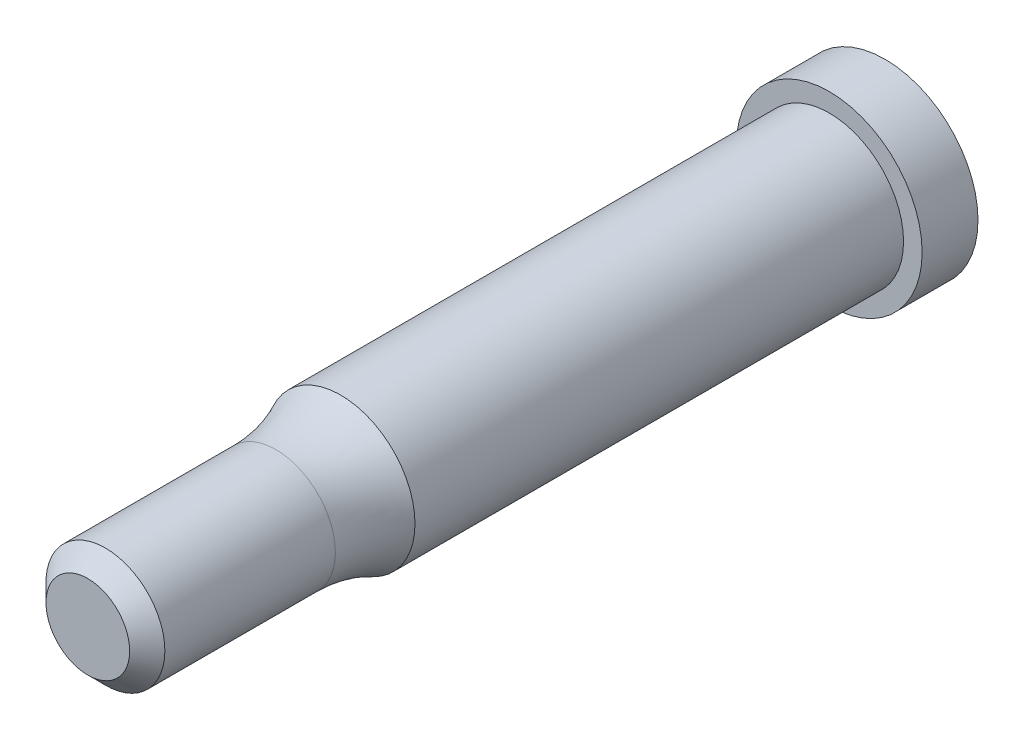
ISO-10303-21;
HEADER;
FILE_DESCRIPTION(('STEP AP214'),'2;1');
FILE_NAME('part.step','',(''),(''),'','','');
FILE_SCHEMA(('AUTOMOTIVE_DESIGN { 1 0 10303 214 1 1 1 1 }'));
ENDSEC;
DATA;
#1=APPLICATION_CONTEXT('core data for automotive mechanical design processes');
#2=APPLICATION_PROTOCOL_DEFINITION('international standard','automotive_design',2000,#1);
#3=PRODUCT_CONTEXT('',#1,'mechanical');
#4=PRODUCT('Part','Part','',(#3));
#5=PRODUCT_RELATED_PRODUCT_CATEGORY('part','',(#4));
#6=PRODUCT_DEFINITION_FORMATION('','',#4);
#7=PRODUCT_DEFINITION_CONTEXT('part definition',#1,'design');
#8=PRODUCT_DEFINITION('design','',#6,#7);
#9=PRODUCT_DEFINITION_SHAPE('','',#8);
#10=(LENGTH_UNIT() NAMED_UNIT(*) SI_UNIT(.MILLI.,.METRE.));
#11=(NAMED_UNIT(*) PLANE_ANGLE_UNIT() SI_UNIT($,.RADIAN.));
#12=(NAMED_UNIT(*) SI_UNIT($,.STERADIAN.) SOLID_ANGLE_UNIT());
#13=UNCERTAINTY_MEASURE_WITH_UNIT(LENGTH_MEASURE(1.E-05),#10,'distance_accuracy_value','');
#14=(GEOMETRIC_REPRESENTATION_CONTEXT(3) GLOBAL_UNCERTAINTY_ASSIGNED_CONTEXT((#13)) GLOBAL_UNIT_ASSIGNED_CONTEXT((#10,
#11,#12)) REPRESENTATION_CONTEXT('',''));
#15=CARTESIAN_POINT('',(0.,0.,0.));
#16=DIRECTION('',(0.,0.,1.));
#17=DIRECTION('',(1.,0.,0.));
#18=AXIS2_PLACEMENT_3D('',#15,#16,#17);
#19=CARTESIAN_POINT('',(0.,0.,43.5171681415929));
#20=DIRECTION('',(0.,0.,1.));
#21=DIRECTION('',(1.,0.,0.));
#22=AXIS2_PLACEMENT_3D('',#19,#20,#21);
#23=CYLINDRICAL_SURFACE('',#22,7.9375);
#24=CARTESIAN_POINT('',(0.,0.,0.));
#25=DIRECTION('',(0.,0.,1.));
#26=DIRECTION('',(1.,0.,0.));
#27=AXIS2_PLACEMENT_3D('',#24,#25,#26);
#28=CIRCLE('',#27,7.9375);
#29=CARTESIAN_POINT('',(7.9375,0.,0.));
#30=VERTEX_POINT('',#29);
#31=EDGE_CURVE('E10',#30,#30,#28,.T.);
#32=ORIENTED_EDGE('',*,*,#31,.F.);
#33=EDGE_LOOP('',(#32));
#34=FACE_BOUND('',#33,.T.);
#35=CARTESIAN_POINT('',(0.,0.,-4.7752));
#36=DIRECTION('',(0.,0.,1.));
#37=DIRECTION('',(1.,0.,0.));
#38=AXIS2_PLACEMENT_3D('',#35,#36,#37);
#39=CIRCLE('',#38,7.9375);
#40=CARTESIAN_POINT('',(7.9375,0.,-4.7752));
#41=VERTEX_POINT('',#40);
#42=EDGE_CURVE('E71',#41,#41,#39,.T.);
#43=ORIENTED_EDGE('',*,*,#42,.T.);
#44=EDGE_LOOP('',(#43));
#45=FACE_BOUND('',#44,.T.);
#46=ADVANCED_FACE('F47',(#34,#45),#23,.T.);
#47=CARTESIAN_POINT('',(-6.35,0.,0.));
#48=DIRECTION('',(0.,0.,-1.));
#49=DIRECTION('',(-1.,0.,0.));
#50=AXIS2_PLACEMENT_3D('',#47,#48,#49);
#51=PLANE('',#50);
#52=CARTESIAN_POINT('',(0.,0.,0.));
#53=DIRECTION('',(0.,0.,1.));
#54=DIRECTION('',(1.,0.,0.));
#55=AXIS2_PLACEMENT_3D('',#52,#53,#54);
#56=CIRCLE('',#55,6.35);
#57=CARTESIAN_POINT('',(6.35,0.,0.));
#58=VERTEX_POINT('',#57);
#59=EDGE_CURVE('E59',#58,#58,#56,.T.);
#60=ORIENTED_EDGE('',*,*,#59,.F.);
#61=EDGE_LOOP('',(#60));
#62=FACE_BOUND('',#61,.T.);
#63=ORIENTED_EDGE('',*,*,#31,.T.);
#64=EDGE_LOOP('',(#63));
#65=FACE_BOUND('',#64,.T.);
#66=ADVANCED_FACE('F106',(#62,#65),#51,.F.);
#67=CARTESIAN_POINT('',(0.,0.,43.5171681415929));
#68=DIRECTION('',(0.,0.,1.));
#69=DIRECTION('',(1.,0.,0.));
#70=AXIS2_PLACEMENT_3D('',#67,#68,#69);
#71=CYLINDRICAL_SURFACE('',#70,6.35);
#72=CARTESIAN_POINT('',(0.,0.,41.7576));
#73=DIRECTION('',(0.,0.,1.));
#74=DIRECTION('',(1.,0.,0.));
#75=AXIS2_PLACEMENT_3D('',#72,#73,#74);
#76=CIRCLE('',#75,6.34999999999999);
#77=CARTESIAN_POINT('',(6.34999999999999,0.,41.7576));
#78=VERTEX_POINT('',#77);
#79=EDGE_CURVE('E63',#78,#78,#76,.T.);
#80=ORIENTED_EDGE('',*,*,#79,.F.);
#81=EDGE_LOOP('',(#80));
#82=FACE_BOUND('',#81,.T.);
#83=ORIENTED_EDGE('',*,*,#59,.T.);
#84=EDGE_LOOP('',(#83));
#85=FACE_BOUND('',#84,.T.);
#86=ADVANCED_FACE('F103',(#82,#85),#71,.T.);
#87=CARTESIAN_POINT('',(0.,0.,47.2934016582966));
#88=DIRECTION('',(0.,0.,1.));
#89=DIRECTION('',(1.,0.,0.));
#90=AXIS2_PLACEMENT_3D('',#87,#88,#89);
#91=TOROIDAL_SURFACE('',#90,17.78,12.7);
#92=CARTESIAN_POINT('',(0.,0.,47.2934016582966));
#93=DIRECTION('',(0.,0.,1.));
#94=DIRECTION('',(1.,0.,0.));
#95=AXIS2_PLACEMENT_3D('',#92,#93,#94);
#96=CIRCLE('',#95,5.07999999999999);
#97=CARTESIAN_POINT('',(5.07999999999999,0.,47.2934016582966));
#98=VERTEX_POINT('',#97);
#99=EDGE_CURVE('E68',#98,#98,#96,.T.);
#100=ORIENTED_EDGE('',*,*,#99,.F.);
#101=EDGE_LOOP('',(#100));
#102=FACE_BOUND('',#101,.T.);
#103=ORIENTED_EDGE('',*,*,#79,.T.);
#104=EDGE_LOOP('',(#103));
#105=FACE_BOUND('',#104,.T.);
#106=ADVANCED_FACE('F99',(#102,#105),#91,.F.);
#107=CARTESIAN_POINT('',(0.,0.,43.5171681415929));
#108=DIRECTION('',(0.,0.,1.));
#109=DIRECTION('',(1.,0.,0.));
#110=AXIS2_PLACEMENT_3D('',#107,#108,#109);
#111=CYLINDRICAL_SURFACE('',#110,5.07999999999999);
#112=CARTESIAN_POINT('',(-3.59210244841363,-3.59210244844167,61.8650721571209));
#113=CARTESIAN_POINT('',(-3.76997061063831,-3.41422821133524,61.8650721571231));
#114=CARTESIAN_POINT('',(-3.93464407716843,-3.22307578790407,61.8650721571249));
#115=CARTESIAN_POINT('',(-4.23396538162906,-2.81839916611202,61.8650721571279));
#116=CARTESIAN_POINT('',(-4.36859071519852,-2.60485837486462,61.8650721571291));
#117=CARTESIAN_POINT('',(-4.6205931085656,-2.13025465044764,61.8650721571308));
#118=CARTESIAN_POINT('',(-4.73323566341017,-1.86665916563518,61.8650721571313));
#119=CARTESIAN_POINT('',(-4.91267294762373,-1.32427284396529,61.8650721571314));
#120=CARTESIAN_POINT('',(-4.97945738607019,-1.04547861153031,61.8650721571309));
#121=CARTESIAN_POINT('',(-5.06526914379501,-0.480650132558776,61.8650721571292));
#122=CARTESIAN_POINT('',(-5.08430059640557,-0.194616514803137,61.8650721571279));
#123=CARTESIAN_POINT('',(-5.07407000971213,0.376568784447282,61.8650721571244));
#124=CARTESIAN_POINT('',(-5.04481044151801,0.661720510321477,61.8650721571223));
#125=CARTESIAN_POINT('',(-4.9388341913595,1.22307121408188,61.8650721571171));
#126=CARTESIAN_POINT('',(-4.86211652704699,1.49927000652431,61.8650721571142));
#127=CARTESIAN_POINT('',(-4.66339940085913,2.03487010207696,61.8650721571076));
#128=CARTESIAN_POINT('',(-4.5413994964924,2.29427124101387,61.8650721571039));
#129=CARTESIAN_POINT('',(-4.25558200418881,2.78890851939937,61.865072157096));
#130=CARTESIAN_POINT('',(-4.0917645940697,3.02414476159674,61.8650721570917));
#131=CARTESIAN_POINT('',(-3.72696232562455,3.4637755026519,61.8650721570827));
#132=CARTESIAN_POINT('',(-3.52597751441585,3.66817004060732,61.8650721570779));
#133=CARTESIAN_POINT('',(-3.09254553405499,4.04031571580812,61.8650721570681));
#134=CARTESIAN_POINT('',(-2.86009834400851,4.20806682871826,61.865072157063));
#135=CARTESIAN_POINT('',(-2.37034021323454,4.50216350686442,61.8650721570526));
#136=CARTESIAN_POINT('',(-2.11302927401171,4.62850907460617,61.8650721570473));
#137=CARTESIAN_POINT('',(-1.58084794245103,4.83620809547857,61.8650721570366));
#138=CARTESIAN_POINT('',(-1.30597755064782,4.91756154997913,61.8650721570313));
#139=CARTESIAN_POINT('',(-0.746480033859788,5.0329669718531,61.8650721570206));
#140=CARTESIAN_POINT('',(-0.461852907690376,5.06701893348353,61.8650721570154));
#141=CARTESIAN_POINT('',(0.109078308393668,5.08685471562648,61.8650721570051));
#142=CARTESIAN_POINT('',(0.39538239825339,5.07263853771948,61.8650721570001));
#143=CARTESIAN_POINT('',(0.961540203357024,4.99634160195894,61.8650721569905));
#144=CARTESIAN_POINT('',(1.24139391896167,4.9342608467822,61.8650721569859));
#145=CARTESIAN_POINT('',(1.78670677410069,4.76399704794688,61.8650721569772));
#146=CARTESIAN_POINT('',(2.05216591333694,4.65581400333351,61.8650721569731));
#147=CARTESIAN_POINT('',(2.56115400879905,4.39641662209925,61.8650721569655));
#148=CARTESIAN_POINT('',(2.80468296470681,4.24520228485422,61.8650721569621));
#149=CARTESIAN_POINT('',(3.26289761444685,3.90403485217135,61.8650721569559));
#150=CARTESIAN_POINT('',(3.47758330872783,3.71408175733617,61.8650721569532));
#151=CARTESIAN_POINT('',(3.87201714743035,3.30082901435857,61.8650721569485));
#152=CARTESIAN_POINT('',(4.05176529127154,3.07752936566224,61.8650721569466));
#153=CARTESIAN_POINT('',(4.37122150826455,2.60392233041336,61.8650721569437));
#154=CARTESIAN_POINT('',(4.51092958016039,2.35361494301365,61.8650721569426));
#155=CARTESIAN_POINT('',(4.74633973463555,1.83309794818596,61.8650721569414));
#156=CARTESIAN_POINT('',(4.84204182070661,1.56288834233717,61.8650721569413));
#157=CARTESIAN_POINT('',(4.98672331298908,1.01023737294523,61.8650721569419));
#158=CARTESIAN_POINT('',(5.03570272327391,0.727796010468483,61.8650721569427));
#159=CARTESIAN_POINT('',(5.08554850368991,0.158699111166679,61.8650721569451));
#160=CARTESIAN_POINT('',(5.0864148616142,-0.127956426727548,61.8650721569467));
#161=CARTESIAN_POINT('',(5.04000990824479,-0.697344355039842,61.8650721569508));
#162=CARTESIAN_POINT('',(4.99273858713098,-0.980076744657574,61.8650721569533));
#163=CARTESIAN_POINT('',(4.85140020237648,-1.53359218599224,61.865072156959));
#164=CARTESIAN_POINT('',(4.75733316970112,-1.80437524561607,61.8650721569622));
#165=CARTESIAN_POINT('',(4.52507368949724,-2.3263054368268,61.8650721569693));
#166=CARTESIAN_POINT('',(4.38688125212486,-2.5774525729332,61.8650721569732));
#167=CARTESIAN_POINT('',(4.07029364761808,-3.0529819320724,61.8650721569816));
#168=CARTESIAN_POINT('',(3.89189843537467,-3.27736412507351,61.8650721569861));
#169=CARTESIAN_POINT('',(3.49996973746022,-3.69299346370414,61.8650721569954));
#170=CARTESIAN_POINT('',(3.28643629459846,-3.88424064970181,61.8650721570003));
#171=CARTESIAN_POINT('',(2.83029223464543,-4.22817157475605,61.8650721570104));
#172=CARTESIAN_POINT('',(2.58768157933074,-4.38085526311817,61.8650721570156));
#173=CARTESIAN_POINT('',(2.08026742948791,-4.64332625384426,61.8650721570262));
#174=CARTESIAN_POINT('',(1.81546367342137,-4.7531130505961,61.8650721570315));
#175=CARTESIAN_POINT('',(1.27118937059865,-4.92666860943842,61.8650721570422));
#176=CARTESIAN_POINT('',(0.991719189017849,-4.99043851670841,61.8650721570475));
#177=CARTESIAN_POINT('',(0.426059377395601,-5.07015311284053,61.865072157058));
#178=CARTESIAN_POINT('',(0.139870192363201,-5.08610096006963,61.8650721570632));
#179=CARTESIAN_POINT('',(-0.431173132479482,-5.06972212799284,61.8650721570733));
#180=CARTESIAN_POINT('',(-0.716027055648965,-5.03738786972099,61.8650721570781));
#181=CARTESIAN_POINT('',(-1.27633115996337,-4.92534813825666,61.8650721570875));
#182=CARTESIAN_POINT('',(-1.55177848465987,-4.84562840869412,61.8650721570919));
#183=CARTESIAN_POINT('',(-2.08522794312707,-4.6410877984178,61.8650721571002));
#184=CARTESIAN_POINT('',(-2.34324315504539,-4.5163011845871,61.8650721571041));
#185=CARTESIAN_POINT('',(-2.77152105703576,-4.26265533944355,61.8650721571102));
#186=CARTESIAN_POINT('',(-2.94732913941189,-4.14303197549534,61.8650721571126));
#187=CARTESIAN_POINT('',(-3.28258623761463,-3.88278601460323,61.8650721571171));
#188=CARTESIAN_POINT('',(-3.44204021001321,-3.74216981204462,61.8650721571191));
#189=CARTESIAN_POINT('',(-3.59210244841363,-3.59210244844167,61.8650721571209));
#190=B_SPLINE_CURVE_WITH_KNOTS('',3,(#112,#113,#114,#115,#116,#117,#118,#119,#120,#121,#122,
#123,#124,#125,#126,#127,#128,#129,#130,#131,#132,#133,#134,#135,#136,#137,#138,#139,#140,#141,
#142,#143,#144,#145,#146,#147,#148,#149,#150,#151,#152,#153,#154,#155,#156,#157,#158,#159,#160,
#161,#162,#163,#164,#165,#166,#167,#168,#169,#170,#171,#172,#173,#174,#175,#176,#177,#178,#179,
#180,#181,#182,#183,#184,#185,#186,#187,#188,#189),.UNSPECIFIED.,.T.,.F.,(4,2,2,2,2,2,2,2,2,2,2,
2,2,2,2,2,2,2,2,2,2,2,2,2,2,2,2,2,2,2,2,2,2,2,2,2,2,2,4),(0.,0.754042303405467,1.50864746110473,
2.36445322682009,3.22045097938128,4.07637463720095,4.93225449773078,5.7881520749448,
6.64405801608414,7.49996031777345,8.35586153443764,9.2117633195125,10.0676650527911,
10.9235667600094,11.7794685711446,12.6353703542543,13.4912720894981,14.3471738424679,
15.2030756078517,16.0589773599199,16.9148791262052,17.7707809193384,18.6266826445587,
19.4825842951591,20.3384861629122,21.1943882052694,22.0502896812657,22.9061909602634,
23.7620931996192,24.6179943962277,25.4738967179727,26.3298091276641,27.1857002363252,
28.0415348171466,28.897503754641,29.753730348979,30.6093072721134,31.2456644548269,
31.8818281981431),.UNSPECIFIED.);
#191=CARTESIAN_POINT('',(-3.59210244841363,-3.59210244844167,61.8650721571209));
#192=VERTEX_POINT('',#191);
#193=EDGE_CURVE('E50',#192,#192,#190,.T.);
#194=ORIENTED_EDGE('',*,*,#193,.T.);
#195=EDGE_LOOP('',(#194));
#196=FACE_BOUND('',#195,.T.);
#197=ORIENTED_EDGE('',*,*,#99,.T.);
#198=EDGE_LOOP('',(#197));
#199=FACE_BOUND('',#198,.T.);
#200=ADVANCED_FACE('F94',(#196,#199),#111,.T.);
#201=CARTESIAN_POINT('',(-7.9375,0.,-4.7752));
#202=DIRECTION('',(0.,0.,1.));
#203=DIRECTION('',(1.,0.,0.));
#204=AXIS2_PLACEMENT_3D('',#201,#202,#203);
#205=PLANE('',#204);
#206=ORIENTED_EDGE('',*,*,#42,.F.);
#207=EDGE_LOOP('',(#206));
#208=FACE_BOUND('',#207,.T.);
#209=ADVANCED_FACE('F92',(#208),#205,.F.);
#210=CARTESIAN_POINT('',(5.59878568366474E-12,1.83045436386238E-12,62.8391051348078));
#211=DIRECTION('',(-1.58417609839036E-11,-5.1379867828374E-12,-1.));
#212=DIRECTION('',(0.655690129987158,-0.755030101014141,-6.50795163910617E-12));
#213=AXIS2_PLACEMENT_3D('',#210,#211,#212);
#214=CONICAL_SURFACE('',#213,4.10596702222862,0.785398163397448);
#215=CARTESIAN_POINT('',(-3.57384719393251,4.56606611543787E-12,63.3712249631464));
#216=CARTESIAN_POINT('',(-3.57385172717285,-0.0589994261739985,63.3712249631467));
#217=CARTESIAN_POINT('',(-3.57244306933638,-0.118001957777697,63.371224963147));
#218=CARTESIAN_POINT('',(-3.56677081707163,-0.235436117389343,63.3712249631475));
#219=CARTESIAN_POINT('',(-3.56252819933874,-0.29386876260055,63.3712249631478));
#220=CARTESIAN_POINT('',(-3.5511891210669,-0.410163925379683,63.3712249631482));
#221=CARTESIAN_POINT('',(-3.54410697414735,-0.468027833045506,63.3712249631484));
#222=CARTESIAN_POINT('',(-3.52709713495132,-0.583184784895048,63.3712249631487));
#223=CARTESIAN_POINT('',(-3.51717677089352,-0.640478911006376,63.3712249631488));
#224=CARTESIAN_POINT('',(-3.49449724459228,-0.754496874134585,63.3712249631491));
#225=CARTESIAN_POINT('',(-3.48173835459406,-0.811220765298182,63.3712249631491));
#226=CARTESIAN_POINT('',(-3.45338888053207,-0.924099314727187,63.3712249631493));
#227=CARTESIAN_POINT('',(-3.4377916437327,-0.980252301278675,63.3712249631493));
#228=CARTESIAN_POINT('',(-3.40377272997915,-1.09199117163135,63.3712249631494));
#229=CARTESIAN_POINT('',(-3.38533781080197,-1.14757302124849,63.3712249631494));
#230=CARTESIAN_POINT('',(-3.34564859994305,-1.25817108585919,63.3712249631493));
#231=CARTESIAN_POINT('',(-3.32437497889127,-1.31318035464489,63.3712249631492));
#232=CARTESIAN_POINT('',(-3.27921174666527,-1.42217653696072,63.3712249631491));
#233=CARTESIAN_POINT('',(-3.25531962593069,-1.47616241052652,63.371224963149));
#234=CARTESIAN_POINT('',(-3.20511679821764,-1.58251053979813,63.3712249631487));
#235=CARTESIAN_POINT('',(-3.17882531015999,-1.63488185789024,63.3712249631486));
#236=CARTESIAN_POINT('',(-3.12382857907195,-1.73800139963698,63.3712249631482));
#237=CARTESIAN_POINT('',(-3.09513624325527,-1.7887565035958,63.3712249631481));
#238=CARTESIAN_POINT('',(-3.03534465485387,-1.88864624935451,63.3712249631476));
#239=CARTESIAN_POINT('',(-3.00425198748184,-1.93778483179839,63.3712249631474));
#240=CARTESIAN_POINT('',(-2.93966603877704,-2.03444459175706,63.3712249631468));
#241=CARTESIAN_POINT('',(-2.90617321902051,-2.08196607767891,63.3712249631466));
#242=CARTESIAN_POINT('',(-2.83679302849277,-2.17539531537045,63.371224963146));
#243=CARTESIAN_POINT('',(-2.80090037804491,-2.22129914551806,63.3712249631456));
#244=CARTESIAN_POINT('',(-2.72672650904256,-2.31149786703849,63.3712249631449));
#245=CARTESIAN_POINT('',(-2.68843481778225,-2.35578414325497,63.3712249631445));
#246=CARTESIAN_POINT('',(-2.60946673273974,-2.44275078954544,63.3712249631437));
#247=CARTESIAN_POINT('',(-2.56877534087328,-2.48541752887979,63.3712249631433));
#248=CARTESIAN_POINT('',(-2.48535343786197,-2.56882002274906,63.3712249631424));
#249=CARTESIAN_POINT('',(-2.44262033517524,-2.60955318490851,63.3712249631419));
#250=CARTESIAN_POINT('',(-2.35554118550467,-2.68859413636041,63.371224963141));
#251=CARTESIAN_POINT('',(-2.31120942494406,-2.72691765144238,63.3712249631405));
#252=CARTESIAN_POINT('',(-2.22093696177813,-2.80114137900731,63.3712249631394));
#253=CARTESIAN_POINT('',(-2.17500555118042,-2.83705288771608,63.3712249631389));
#254=CARTESIAN_POINT('',(-2.08153916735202,-2.90645772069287,63.3712249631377));
#255=CARTESIAN_POINT('',(-2.03400877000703,-2.93995720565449,63.3712249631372));
#256=CARTESIAN_POINT('',(-1.93734904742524,-3.0045432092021,63.371224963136));
#257=CARTESIAN_POINT('',(-1.88822003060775,-3.03563018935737,63.3712249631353));
#258=CARTESIAN_POINT('',(-1.78836727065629,-3.09539689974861,63.3712249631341));
#259=CARTESIAN_POINT('',(-1.73764015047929,-3.1240709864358,63.3712249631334));
#260=CARTESIAN_POINT('',(-1.63459487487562,-3.17901862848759,63.3712249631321));
#261=CARTESIAN_POINT('',(-1.5822703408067,-3.20528021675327,63.3712249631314));
#262=CARTESIAN_POINT('',(-1.47603264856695,-3.25540714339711,63.3712249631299));
#263=CARTESIAN_POINT('',(-1.42211085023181,-3.27925414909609,63.3712249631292));
#264=CARTESIAN_POINT('',(-1.31312230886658,-3.32438382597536,63.3712249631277));
#265=CARTESIAN_POINT('',(-1.25805416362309,-3.34566311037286,63.3712249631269));
#266=CARTESIAN_POINT('',(-1.14735585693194,-3.38536367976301,63.3712249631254));
#267=CARTESIAN_POINT('',(-1.09173287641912,-3.40380496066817,63.3712249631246));
#268=CARTESIAN_POINT('',(-0.979927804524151,-3.43783296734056,63.371224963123));
#269=CARTESIAN_POINT('',(-0.9237499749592,-3.45343368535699,63.3712249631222));
#270=CARTESIAN_POINT('',(-0.810838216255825,-3.48178735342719,63.3712249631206));
#271=CARTESIAN_POINT('',(-0.754106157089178,-3.49454774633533,63.3712249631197));
#272=CARTESIAN_POINT('',(-0.640088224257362,-3.51722735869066,63.371224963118));
#273=CARTESIAN_POINT('',(-0.582802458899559,-3.52714712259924,63.3712249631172));
#274=CARTESIAN_POINT('',(-0.467678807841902,-3.54415236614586,63.3712249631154));
#275=CARTESIAN_POINT('',(-0.409839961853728,-3.55123133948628,63.3712249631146));
#276=CARTESIAN_POINT('',(-0.2936109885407,-3.56256262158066,63.3712249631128));
#277=CARTESIAN_POINT('',(-0.235219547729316,-3.56680143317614,63.3712249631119));
#278=CARTESIAN_POINT('',(-0.117885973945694,-3.57245727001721,63.3712249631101));
#279=CARTESIAN_POINT('',(-0.0589428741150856,-3.57385405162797,63.3712249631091));
#280=CARTESIAN_POINT('',(0.0590197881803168,-3.57384032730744,63.3712249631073));
#281=CARTESIAN_POINT('',(0.118039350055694,-3.57242615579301,63.3712249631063));
#282=CARTESIAN_POINT('',(0.235504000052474,-3.56674229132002,63.3712249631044));
#283=CARTESIAN_POINT('',(0.29395010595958,-3.56249382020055,63.3712249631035));
#284=CARTESIAN_POINT('',(0.410266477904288,-3.55114565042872,63.3712249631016));
#285=CARTESIAN_POINT('',(0.468138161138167,-3.54406050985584,63.3712249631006));
#286=CARTESIAN_POINT('',(0.583305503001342,-3.52704642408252,63.3712249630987));
#287=CARTESIAN_POINT('',(0.64060228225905,-3.51712507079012,63.3712249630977));
#288=CARTESIAN_POINT('',(0.754620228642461,-3.49444552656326,63.3712249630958));
#289=CARTESIAN_POINT('',(0.811341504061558,-3.48168788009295,63.3712249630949));
#290=CARTESIAN_POINT('',(0.924209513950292,-3.45334276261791,63.3712249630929));
#291=CARTESIAN_POINT('',(0.980354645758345,-3.43774891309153,63.371224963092));
#292=CARTESIAN_POINT('',(1.09207250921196,-3.40373875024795,63.37122496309));
#293=CARTESIAN_POINT('',(1.14764128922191,-3.38530946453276,63.371224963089));
#294=CARTESIAN_POINT('',(1.25820777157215,-3.34563316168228,63.3712249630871));
#295=CARTESIAN_POINT('',(1.31319862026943,-3.32436707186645,63.3712249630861));
#296=CARTESIAN_POINT('',(1.4221766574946,-3.27921203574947,63.3712249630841));
#297=CARTESIAN_POINT('',(1.47616244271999,-3.25531970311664,63.3712249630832));
#298=CARTESIAN_POINT('',(1.58251050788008,-3.20511672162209,63.3712249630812));
#299=CARTESIAN_POINT('',(1.63488184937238,-3.17882528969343,63.3712249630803));
#300=CARTESIAN_POINT('',(1.73800140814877,-3.12382859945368,63.3712249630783));
#301=CARTESIAN_POINT('',(1.78875650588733,-3.09513624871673,63.3712249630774));
#302=CARTESIAN_POINT('',(1.88864624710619,-3.03534464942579,63.3712249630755));
#303=CARTESIAN_POINT('',(1.93778483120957,-3.00425198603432,63.3712249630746));
#304=CARTESIAN_POINT('',(2.03444459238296,-2.93966604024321,63.3712249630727));
#305=CARTESIAN_POINT('',(2.08196607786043,-2.90617321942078,63.3712249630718));
#306=CARTESIAN_POINT('',(2.17539531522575,-2.83679302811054,63.3712249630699));
#307=CARTESIAN_POINT('',(2.22129914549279,-2.80090037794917,63.371224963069));
#308=CARTESIAN_POINT('',(2.31149786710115,-2.72672650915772,63.3712249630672));
#309=CARTESIAN_POINT('',(2.35578414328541,-2.68843481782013,63.3712249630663));
#310=CARTESIAN_POINT('',(2.4427507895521,-2.60946673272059,63.3712249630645));
#311=CARTESIAN_POINT('',(2.48541752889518,-2.56877534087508,63.3712249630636));
#312=CARTESIAN_POINT('',(2.56882002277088,-2.48535343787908,63.3712249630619));
#313=CARTESIAN_POINT('',(2.60955318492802,-2.44262033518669,63.371224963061));
#314=CARTESIAN_POINT('',(2.68859413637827,-2.35554118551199,63.3712249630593));
#315=CARTESIAN_POINT('',(2.72691765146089,-2.31120942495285,63.3712249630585));
#316=CARTESIAN_POINT('',(2.8011413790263,-2.22093696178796,63.3712249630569));
#317=CARTESIAN_POINT('',(2.83705288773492,-2.17500555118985,63.3712249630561));
#318=CARTESIAN_POINT('',(2.9064577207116,-2.08153916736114,63.3712249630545));
#319=CARTESIAN_POINT('',(2.93995720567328,-2.03400877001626,63.3712249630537));
#320=CARTESIAN_POINT('',(3.00454320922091,-1.93734904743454,63.3712249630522));
#321=CARTESIAN_POINT('',(3.03563018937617,-1.88822003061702,63.3712249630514));
#322=CARTESIAN_POINT('',(3.09539689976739,-1.78836727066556,63.37122496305));
#323=CARTESIAN_POINT('',(3.12407098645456,-1.73764015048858,63.3712249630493));
#324=CARTESIAN_POINT('',(3.17901862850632,-1.63459487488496,63.3712249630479));
#325=CARTESIAN_POINT('',(3.20528021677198,-1.58227034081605,63.3712249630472));
#326=CARTESIAN_POINT('',(3.25540714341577,-1.47603264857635,63.3712249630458));
#327=CARTESIAN_POINT('',(3.27925414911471,-1.42211085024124,63.3712249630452));
#328=CARTESIAN_POINT('',(3.32438382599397,-1.31312230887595,63.3712249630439));
#329=CARTESIAN_POINT('',(3.3456631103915,-1.25805416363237,63.3712249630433));
#330=CARTESIAN_POINT('',(3.38536367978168,-1.14735585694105,63.3712249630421));
#331=CARTESIAN_POINT('',(3.40380496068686,-1.09173287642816,63.3712249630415));
#332=CARTESIAN_POINT('',(3.43783296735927,-0.97992780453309,63.3712249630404));
#333=CARTESIAN_POINT('',(3.45343368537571,-0.923749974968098,63.3712249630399));
#334=CARTESIAN_POINT('',(3.48178735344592,-0.81083821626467,63.3712249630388));
#335=CARTESIAN_POINT('',(3.49454774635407,-0.754106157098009,63.3712249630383));
#336=CARTESIAN_POINT('',(3.5172273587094,-0.640088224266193,63.3712249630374));
#337=CARTESIAN_POINT('',(3.52714712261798,-0.582802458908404,63.3712249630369));
#338=CARTESIAN_POINT('',(3.54415236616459,-0.4676788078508,63.3712249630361));
#339=CARTESIAN_POINT('',(3.55123133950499,-0.409839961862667,63.3712249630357));
#340=CARTESIAN_POINT('',(3.56256262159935,-0.293610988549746,63.3712249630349));
#341=CARTESIAN_POINT('',(3.56680143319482,-0.23521954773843,63.3712249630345));
#342=CARTESIAN_POINT('',(3.57245727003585,-0.11788597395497,63.3712249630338));
#343=CARTESIAN_POINT('',(3.57385405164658,-0.0589428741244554,63.3712249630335));
#344=CARTESIAN_POINT('',(3.57384032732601,0.0590197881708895,63.3712249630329));
#345=CARTESIAN_POINT('',(3.57242615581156,0.118039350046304,63.3712249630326));
#346=CARTESIAN_POINT('',(3.56674229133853,0.235504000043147,63.3712249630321));
#347=CARTESIAN_POINT('',(3.56249382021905,0.293950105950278,63.3712249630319));
#348=CARTESIAN_POINT('',(3.55114565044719,0.410266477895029,63.3712249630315));
#349=CARTESIAN_POINT('',(3.54406050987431,0.468138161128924,63.3712249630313));
#350=CARTESIAN_POINT('',(3.52704642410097,0.583305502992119,63.3712249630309));
#351=CARTESIAN_POINT('',(3.51712507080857,0.640602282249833,63.3712249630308));
#352=CARTESIAN_POINT('',(3.4944455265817,0.754620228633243,63.3712249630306));
#353=CARTESIAN_POINT('',(3.48168788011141,0.811341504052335,63.3712249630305));
#354=CARTESIAN_POINT('',(3.45334276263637,0.924209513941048,63.3712249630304));
#355=CARTESIAN_POINT('',(3.43774891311,0.980354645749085,63.3712249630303));
#356=CARTESIAN_POINT('',(3.40373875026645,1.09207250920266,63.3712249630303));
#357=CARTESIAN_POINT('',(3.38530946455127,1.14764128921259,63.3712249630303));
#358=CARTESIAN_POINT('',(3.34563316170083,1.25820777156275,63.3712249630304));
#359=CARTESIAN_POINT('',(3.32436707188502,1.31319862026,63.3712249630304));
#360=CARTESIAN_POINT('',(3.2792120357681,1.42217665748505,63.3712249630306));
#361=CARTESIAN_POINT('',(3.25531970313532,1.47616244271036,63.3712249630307));
#362=CARTESIAN_POINT('',(3.20511672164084,1.58251050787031,63.3712249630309));
#363=CARTESIAN_POINT('',(3.1788252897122,1.63488184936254,63.3712249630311));
#364=CARTESIAN_POINT('',(3.1238285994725,1.73800140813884,63.3712249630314));
#365=CARTESIAN_POINT('',(3.09513624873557,1.78875650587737,63.3712249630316));
#366=CARTESIAN_POINT('',(3.03534464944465,1.88864624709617,63.371224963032));
#367=CARTESIAN_POINT('',(3.00425198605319,1.93778483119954,63.3712249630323));
#368=CARTESIAN_POINT('',(2.93966604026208,2.03444459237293,63.3712249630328));
#369=CARTESIAN_POINT('',(2.90617321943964,2.08196607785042,63.3712249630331));
#370=CARTESIAN_POINT('',(2.83679302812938,2.17539531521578,63.3712249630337));
#371=CARTESIAN_POINT('',(2.80090037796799,2.22129914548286,63.3712249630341));
#372=CARTESIAN_POINT('',(2.7267265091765,2.31149786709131,63.3712249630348));
#373=CARTESIAN_POINT('',(2.68843481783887,2.35578414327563,63.3712249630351));
#374=CARTESIAN_POINT('',(2.60946673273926,2.44275078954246,63.3712249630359));
#375=CARTESIAN_POINT('',(2.56877534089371,2.48541752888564,63.3712249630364));
#376=CARTESIAN_POINT('',(2.48535343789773,2.5688200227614,63.3712249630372));
#377=CARTESIAN_POINT('',(2.4426203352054,2.60955318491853,63.3712249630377));
#378=CARTESIAN_POINT('',(2.3555411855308,2.68859413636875,63.3712249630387));
#379=CARTESIAN_POINT('',(2.3112094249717,2.72691765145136,63.3712249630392));
#380=CARTESIAN_POINT('',(2.22093696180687,2.80114137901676,63.3712249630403));
#381=CARTESIAN_POINT('',(2.17500555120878,2.83705288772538,63.3712249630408));
#382=CARTESIAN_POINT('',(2.08153916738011,2.90645772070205,63.3712249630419));
#383=CARTESIAN_POINT('',(2.03400877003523,2.93995720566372,63.3712249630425));
#384=CARTESIAN_POINT('',(1.93734904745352,3.00454320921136,63.3712249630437));
#385=CARTESIAN_POINT('',(1.88822003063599,3.03563018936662,63.3712249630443));
#386=CARTESIAN_POINT('',(1.7883672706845,3.09539689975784,63.3712249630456));
#387=CARTESIAN_POINT('',(1.73764015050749,3.12407098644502,63.3712249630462));
#388=CARTESIAN_POINT('',(1.6345948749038,3.1790186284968,63.3712249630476));
#389=CARTESIAN_POINT('',(1.58227034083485,3.20528021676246,63.3712249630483));
#390=CARTESIAN_POINT('',(1.47603264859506,3.25540714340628,63.3712249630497));
#391=CARTESIAN_POINT('',(1.42211085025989,3.27925414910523,63.3712249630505));
#392=CARTESIAN_POINT('',(1.31312230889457,3.32438382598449,63.371224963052));
#393=CARTESIAN_POINT('',(1.25805416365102,3.34566311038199,63.3712249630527));
#394=CARTESIAN_POINT('',(1.14735585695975,3.38536367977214,63.3712249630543));
#395=CARTESIAN_POINT('',(1.09173287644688,3.4038049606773,63.371224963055));
#396=CARTESIAN_POINT('',(0.97992780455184,3.43783296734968,63.3712249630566));
#397=CARTESIAN_POINT('',(0.923749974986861,3.45343368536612,63.3712249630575));
#398=CARTESIAN_POINT('',(0.81083821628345,3.48178735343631,63.3712249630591));
#399=CARTESIAN_POINT('',(0.754106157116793,3.49454774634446,63.3712249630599));
#400=CARTESIAN_POINT('',(0.640088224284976,3.51722735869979,63.3712249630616));
#401=CARTESIAN_POINT('',(0.582802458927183,3.52714712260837,63.3712249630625));
#402=CARTESIAN_POINT('',(0.467678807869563,3.54415236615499,63.3712249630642));
#403=CARTESIAN_POINT('',(0.409839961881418,3.55123133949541,63.3712249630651));
#404=CARTESIAN_POINT('',(0.293610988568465,3.56256262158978,63.3712249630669));
#405=CARTESIAN_POINT('',(0.235219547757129,3.56680143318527,63.3712249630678));
#406=CARTESIAN_POINT('',(0.11788597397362,3.57245727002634,63.3712249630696));
#407=CARTESIAN_POINT('',(0.0589428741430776,3.5738540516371,63.3712249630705));
#408=CARTESIAN_POINT('',(-0.059019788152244,3.57384032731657,63.3712249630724));
#409=CARTESIAN_POINT('',(-0.118039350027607,3.57242615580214,63.3712249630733));
#410=CARTESIAN_POINT('',(-0.235504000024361,3.56674229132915,63.3712249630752));
#411=CARTESIAN_POINT('',(-0.293950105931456,3.56249382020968,63.3712249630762));
#412=CARTESIAN_POINT('',(-0.410266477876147,3.55114565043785,63.3712249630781));
#413=CARTESIAN_POINT('',(-0.46813816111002,3.54406050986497,63.371224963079));
#414=CARTESIAN_POINT('',(-0.583305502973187,3.52704642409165,63.371224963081));
#415=CARTESIAN_POINT('',(-0.640602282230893,3.51712507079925,63.3712249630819));
#416=CARTESIAN_POINT('',(-0.754620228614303,3.49444552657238,63.3712249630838));
#417=CARTESIAN_POINT('',(-0.811341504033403,3.48168788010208,63.3712249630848));
#418=CARTESIAN_POINT('',(-0.924209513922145,3.45334276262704,63.3712249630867));
#419=CARTESIAN_POINT('',(-0.980354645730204,3.43774891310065,63.3712249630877));
#420=CARTESIAN_POINT('',(-1.09207250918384,3.40373875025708,63.3712249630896));
#421=CARTESIAN_POINT('',(-1.1476412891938,3.38530946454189,63.3712249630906));
#422=CARTESIAN_POINT('',(-1.25820777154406,3.34563316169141,63.3712249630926));
#423=CARTESIAN_POINT('',(-1.31319862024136,3.32436707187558,63.3712249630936));
#424=CARTESIAN_POINT('',(-1.42217665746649,3.27921203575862,63.3712249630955));
#425=CARTESIAN_POINT('',(-1.47616244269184,3.25531970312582,63.3712249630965));
#426=CARTESIAN_POINT('',(-1.58251050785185,3.20511672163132,63.3712249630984));
#427=CARTESIAN_POINT('',(-1.63488184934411,3.17882528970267,63.3712249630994));
#428=CARTESIAN_POINT('',(-1.73800140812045,3.12382859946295,63.3712249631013));
#429=CARTESIAN_POINT('',(-1.78875650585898,3.09513624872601,63.3712249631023));
#430=CARTESIAN_POINT('',(-1.88864624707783,3.03534464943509,63.3712249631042));
#431=CARTESIAN_POINT('',(-1.93778483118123,3.00425198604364,63.3712249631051));
#432=CARTESIAN_POINT('',(-2.03444459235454,2.93966604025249,63.3712249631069));
#433=CARTESIAN_POINT('',(-2.08196607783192,2.90617321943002,63.3712249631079));
#434=CARTESIAN_POINT('',(-2.17539531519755,2.83679302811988,63.3712249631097));
#435=CARTESIAN_POINT('',(-2.22129914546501,2.80090037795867,63.3712249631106));
#436=CARTESIAN_POINT('',(-2.31149786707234,2.72672650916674,63.3712249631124));
#437=CARTESIAN_POINT('',(-2.35578414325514,2.68843481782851,63.3712249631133));
#438=CARTESIAN_POINT('',(-2.44275078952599,2.60946673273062,63.3712249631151));
#439=CARTESIAN_POINT('',(-2.48541752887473,2.56877534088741,63.371224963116));
#440=CARTESIAN_POINT('',(-2.56882002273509,2.48535343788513,63.3712249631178));
#441=CARTESIAN_POINT('',(-2.6095531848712,2.44262033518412,63.3712249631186));
#442=CARTESIAN_POINT('',(-2.68859413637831,2.3555411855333,63.3712249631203));
#443=CARTESIAN_POINT('',(-2.72691765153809,2.31120942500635,63.3712249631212));
#444=CARTESIAN_POINT('',(-2.80114137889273,2.22093696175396,63.3712249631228));
#445=CARTESIAN_POINT('',(-2.83705288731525,2.17500555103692,63.3712249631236));
#446=CARTESIAN_POINT('',(-2.90645772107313,2.08153916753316,63.3712249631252));
#447=CARTESIAN_POINT('',(-2.9399572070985,2.03400877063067,63.3712249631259));
#448=CARTESIAN_POINT('',(-3.00454320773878,1.93734904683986,63.3712249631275));
#449=CARTESIAN_POINT('',(-3.03563018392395,1.88822002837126,63.3712249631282));
#450=CARTESIAN_POINT('',(-3.09539690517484,1.78836727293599,63.3712249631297));
#451=CARTESIAN_POINT('',(-3.1240710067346,1.73764015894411,63.3712249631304));
#452=CARTESIAN_POINT('',(-3.17901860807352,1.63459486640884,63.3712249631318));
#453=CARTESIAN_POINT('',(-3.20528014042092,1.58227030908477,63.3712249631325));
#454=CARTESIAN_POINT('',(-3.25540722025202,1.47603268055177,63.3712249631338));
#455=CARTESIAN_POINT('',(-3.27925443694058,1.42211096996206,63.3712249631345));
#456=CARTESIAN_POINT('',(-3.32437592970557,1.31314056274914,63.3712249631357));
#457=CARTESIAN_POINT('',(-3.34564769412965,1.25809082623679,63.3712249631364));
#458=CARTESIAN_POINT('',(-3.38533537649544,1.14742408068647,63.3712249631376));
#459=CARTESIAN_POINT('',(-3.40377103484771,1.09181416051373,63.3712249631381));
#460=CARTESIAN_POINT('',(-3.43779029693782,0.980030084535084,63.3712249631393));
#461=CARTESIAN_POINT('',(-3.45338762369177,0.923860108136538,63.3712249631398));
#462=CARTESIAN_POINT('',(-3.4817369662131,0.81095887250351,63.3712249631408));
#463=CARTESIAN_POINT('',(-3.49449615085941,0.754229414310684,63.3712249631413));
#464=CARTESIAN_POINT('',(-3.51717568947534,0.640211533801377,63.3712249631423));
#465=CARTESIAN_POINT('',(-3.52709631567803,0.582923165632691,63.3712249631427));
#466=CARTESIAN_POINT('',(-3.54410614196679,0.467788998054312,63.3712249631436));
#467=CARTESIAN_POINT('',(-3.55118857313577,0.409942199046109,63.371224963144));
#468=CARTESIAN_POINT('',(-3.56252764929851,0.293692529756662,63.3712249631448));
#469=CARTESIAN_POINT('',(-3.56677054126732,0.235288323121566,63.3712249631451));
#470=CARTESIAN_POINT('',(-3.57244280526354,0.117922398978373,63.3712249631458));
#471=CARTESIAN_POINT('',(-3.5738517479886,0.0589596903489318,63.3712249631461));
#472=CARTESIAN_POINT('',(-3.57384719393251,4.56606611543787E-12,63.3712249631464));
#473=B_SPLINE_CURVE_WITH_KNOTS('',3,(#215,#216,#217,#218,#219,#220,#221,#222,#223,#224,#225,
#226,#227,#228,#229,#230,#231,#232,#233,#234,#235,#236,#237,#238,#239,#240,#241,#242,#243,#244,
#245,#246,#247,#248,#249,#250,#251,#252,#253,#254,#255,#256,#257,#258,#259,#260,#261,#262,#263,
#264,#265,#266,#267,#268,#269,#270,#271,#272,#273,#274,#275,#276,#277,#278,#279,#280,#281,#282,
#283,#284,#285,#286,#287,#288,#289,#290,#291,#292,#293,#294,#295,#296,#297,#298,#299,#300,#301,
#302,#303,#304,#305,#306,#307,#308,#309,#310,#311,#312,#313,#314,#315,#316,#317,#318,#319,#320,
#321,#322,#323,#324,#325,#326,#327,#328,#329,#330,#331,#332,#333,#334,#335,#336,#337,#338,#339,
#340,#341,#342,#343,#344,#345,#346,#347,#348,#349,#350,#351,#352,#353,#354,#355,#356,#357,#358,
#359,#360,#361,#362,#363,#364,#365,#366,#367,#368,#369,#370,#371,#372,#373,#374,#375,#376,#377,
#378,#379,#380,#381,#382,#383,#384,#385,#386,#387,#388,#389,#390,#391,#392,#393,#394,#395,#396,
#397,#398,#399,#400,#401,#402,#403,#404,#405,#406,#407,#408,#409,#410,#411,#412,#413,#414,#415,
#416,#417,#418,#419,#420,#421,#422,#423,#424,#425,#426,#427,#428,#429,#430,#431,#432,#433,#434,
#435,#436,#437,#438,#439,#440,#441,#442,#443,#444,#445,#446,#447,#448,#449,#450,#451,#452,#453,
#454,#455,#456,#457,#458,#459,#460,#461,#462,#463,#464,#465,#466,#467,#468,#469,#470,#471,#472),
.UNSPECIFIED.,.F.,.F.,(4,2,2,2,2,2,2,2,2,2,2,2,2,2,2,2,2,2,2,2,2,2,2,2,2,2,2,2,2,2,2,2,2,2,2,2,
2,2,2,2,2,2,2,2,2,2,2,2,2,2,2,2,2,2,2,2,2,2,2,2,2,2,2,2,2,2,2,2,2,2,2,2,2,2,2,2,2,2,2,2,2,2,2,2,
2,2,2,2,2,2,2,2,2,2,2,2,2,2,2,2,2,2,2,2,2,2,2,2,2,2,2,2,2,2,2,2,2,2,2,2,2,2,2,2,2,2,2,2,4),(0.,
0.176985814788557,0.35267590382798,0.527491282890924,0.701859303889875,0.87621060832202,
1.05097596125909,1.2265830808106,1.40345357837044,1.58049509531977,1.75622567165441,
1.93106570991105,2.10544205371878,2.27978495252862,2.45452490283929,2.63008948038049,
2.80690027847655,2.9839417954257,3.15967237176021,3.33451241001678,3.50888875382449,
3.68323165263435,3.85797160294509,4.03353618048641,4.21034697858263,4.38738849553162,
4.56311907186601,4.73795911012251,4.9123354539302,5.08667835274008,5.2614183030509,
5.43698288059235,5.61379367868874,5.7908351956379,5.96656577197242,6.14140581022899,
6.3157821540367,6.49012505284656,6.6648650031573,6.84042958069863,7.01724037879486,
7.19428189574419,7.37001247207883,7.54485251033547,7.7192288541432,7.89357175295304,
8.06831170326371,8.24387628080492,8.42068707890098,8.59772859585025,8.77345917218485,
8.94829921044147,9.1226755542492,9.29701845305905,9.47175840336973,9.64732298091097,
9.82413377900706,10.0011752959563,10.1769058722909,10.3517459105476,10.5261222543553,
10.7004651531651,10.8752051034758,11.0507696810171,11.2275804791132,11.4046219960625,
11.5803525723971,11.7551926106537,11.9295689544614,12.1039118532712,12.2786518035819,
12.4542163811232,12.6310271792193,12.8080686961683,12.9837992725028,13.1586393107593,
13.333015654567,13.5073585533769,13.6820985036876,13.857663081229,14.0344738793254,
14.2115153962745,14.387245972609,14.5620860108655,14.7364623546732,14.9108052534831,
15.0855452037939,15.2611097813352,15.4379205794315,15.6149620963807,15.7906926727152,
15.9655327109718,16.1399090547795,16.3142519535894,16.4889919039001,16.6645564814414,
16.8413672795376,17.0184087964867,17.1941393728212,17.3689794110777,17.5433557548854,
17.7176986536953,17.8924386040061,18.0680031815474,18.2448139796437,18.4218554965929,
18.5975860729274,18.772426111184,18.9468024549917,19.1211453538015,19.2958853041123,
19.4714498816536,19.6482606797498,19.8253021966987,20.001032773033,20.1758728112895,
20.3502491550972,20.5245920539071,20.6993320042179,20.8748965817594,21.0517073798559,
21.228689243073,21.4043773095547,21.5791919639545,21.7535599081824,21.9279111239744,
22.1026757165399,22.2782807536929,22.4551472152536),.UNSPECIFIED.);
#474=CARTESIAN_POINT('',(-3.57384719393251,4.56606611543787E-12,63.3712249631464));
#475=VERTEX_POINT('',#474);
#476=EDGE_CURVE('E171',#475,#475,#473,.T.);
#477=ORIENTED_EDGE('',*,*,#476,.F.);
#478=EDGE_LOOP('',(#477));
#479=FACE_BOUND('',#478,.T.);
#480=ORIENTED_EDGE('',*,*,#193,.F.);
#481=EDGE_LOOP('',(#480));
#482=FACE_BOUND('',#481,.T.);
#483=ADVANCED_FACE('F89',(#479,#482),#214,.T.);
#484=CARTESIAN_POINT('',(3.57384719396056,4.56368545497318E-12,63.3712249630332));
#485=DIRECTION('',(-1.58417609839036E-11,-5.1379867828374E-12,-1.));
#486=DIRECTION('',(-1.,0.,1.58417609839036E-11));
#487=AXIS2_PLACEMENT_3D('',#484,#485,#486);
#488=PLANE('',#487);
#489=ORIENTED_EDGE('',*,*,#476,.T.);
#490=EDGE_LOOP('',(#489));
#491=FACE_BOUND('',#490,.T.);
#492=ADVANCED_FACE('F80',(#491),#488,.F.);
#493=CLOSED_SHELL('',(#46,#66,#86,#106,#200,#209,#483,#492));
#494=MANIFOLD_SOLID_BREP('B2',#493);
#495=ADVANCED_BREP_SHAPE_REPRESENTATION('',(#18,#494),#14);
#496=SHAPE_DEFINITION_REPRESENTATION(#9,#495);
ENDSEC;
END-ISO-10303-21;
